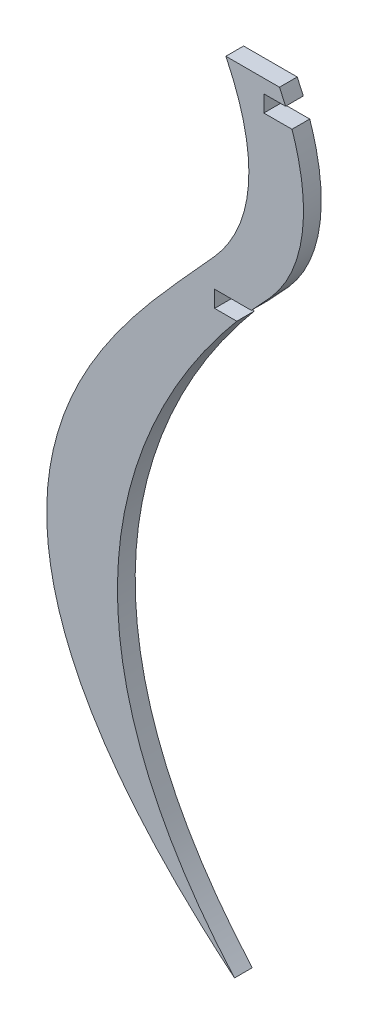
ISO-10303-21;
HEADER;
FILE_DESCRIPTION(('STEP AP214'),'2;1');
FILE_NAME('part.step','',(''),(''),'','','');
FILE_SCHEMA(('AUTOMOTIVE_DESIGN { 1 0 10303 214 1 1 1 1 }'));
ENDSEC;
DATA;
#1=APPLICATION_CONTEXT('core data for automotive mechanical design processes');
#2=APPLICATION_PROTOCOL_DEFINITION('international standard','automotive_design',2000,#1);
#3=PRODUCT_CONTEXT('',#1,'mechanical');
#4=PRODUCT('Part','Part','',(#3));
#5=PRODUCT_RELATED_PRODUCT_CATEGORY('part','',(#4));
#6=PRODUCT_DEFINITION_FORMATION('','',#4);
#7=PRODUCT_DEFINITION_CONTEXT('part definition',#1,'design');
#8=PRODUCT_DEFINITION('design','',#6,#7);
#9=PRODUCT_DEFINITION_SHAPE('','',#8);
#10=(LENGTH_UNIT() NAMED_UNIT(*) SI_UNIT(.MILLI.,.METRE.));
#11=(NAMED_UNIT(*) PLANE_ANGLE_UNIT() SI_UNIT($,.RADIAN.));
#12=(NAMED_UNIT(*) SI_UNIT($,.STERADIAN.) SOLID_ANGLE_UNIT());
#13=UNCERTAINTY_MEASURE_WITH_UNIT(LENGTH_MEASURE(1.E-05),#10,'distance_accuracy_value','');
#14=(GEOMETRIC_REPRESENTATION_CONTEXT(3) GLOBAL_UNCERTAINTY_ASSIGNED_CONTEXT((#13)) GLOBAL_UNIT_ASSIGNED_CONTEXT((#10,
#11,#12)) REPRESENTATION_CONTEXT('',''));
#15=CARTESIAN_POINT('',(0.,0.,0.));
#16=DIRECTION('',(0.,0.,1.));
#17=DIRECTION('',(1.,0.,0.));
#18=AXIS2_PLACEMENT_3D('',#15,#16,#17);
#19=CARTESIAN_POINT('',(-237.1773,-95.6704,5.36));
#20=CARTESIAN_POINT('',(-304.5292,-19.3041,5.36));
#21=CARTESIAN_POINT('',(-259.1311,49.665,5.36));
#22=CARTESIAN_POINT('',(-236.4907,76.6189,5.36));
#23=B_SPLINE_CURVE_WITH_KNOTS('',3,(#19,#20,#21,#22),.UNSPECIFIED.,.F.,.F.,(4,4),(0.,1.),.UNSPECIFIED.);
#24=DIRECTION('',(0.,0.,-1.));
#25=VECTOR('',#24,1.);
#26=SURFACE_OF_LINEAR_EXTRUSION('',#23,#25);
#27=CARTESIAN_POINT('',(-237.1773,-95.6704,0.));
#28=CARTESIAN_POINT('',(-304.5292,-19.3041,0.));
#29=CARTESIAN_POINT('',(-259.1311,49.665,0.));
#30=CARTESIAN_POINT('',(-236.4907,76.6189,0.));
#31=B_SPLINE_CURVE_WITH_KNOTS('',3,(#27,#28,#29,#30),.UNSPECIFIED.,.F.,.F.,(4,4),(0.,1.),.UNSPECIFIED.);
#32=CARTESIAN_POINT('',(-237.1773,-95.6704,0.));
#33=VERTEX_POINT('',#32);
#34=CARTESIAN_POINT('',(-236.4907,76.6189,0.));
#35=VERTEX_POINT('',#34);
#36=EDGE_CURVE('E242',#33,#35,#31,.T.);
#37=ORIENTED_EDGE('',*,*,#36,.T.);
#38=DIRECTION('',(0.,0.,-1.));
#39=VECTOR('',#38,1.);
#40=CARTESIAN_POINT('',(-236.4907,76.6189,5.36));
#41=LINE('',#40,#39);
#42=CARTESIAN_POINT('',(-236.4907,76.6189,5.36));
#43=VERTEX_POINT('',#42);
#44=EDGE_CURVE('E11',#43,#35,#41,.T.);
#45=ORIENTED_EDGE('',*,*,#44,.F.);
#46=CARTESIAN_POINT('',(-237.1773,-95.6704,5.36));
#47=VERTEX_POINT('',#46);
#48=EDGE_CURVE('E292',#47,#43,#23,.T.);
#49=ORIENTED_EDGE('',*,*,#48,.F.);
#50=DIRECTION('',(0.,0.,-1.));
#51=VECTOR('',#50,1.);
#52=CARTESIAN_POINT('',(-237.1773,-95.6704,5.36));
#53=LINE('',#52,#51);
#54=EDGE_CURVE('E156',#47,#33,#53,.T.);
#55=ORIENTED_EDGE('',*,*,#54,.T.);
#56=EDGE_LOOP('',(#37,#45,#49,#55));
#57=FACE_BOUND('',#56,.T.);
#58=ADVANCED_FACE('F33',(#57),#26,.F.);
#59=CARTESIAN_POINT('',(-236.4907,76.6189,5.36));
#60=DIRECTION('',(0.,-1.,0.));
#61=DIRECTION('',(0.,0.,-1.));
#62=AXIS2_PLACEMENT_3D('',#59,#60,#61);
#63=PLANE('',#62);
#64=DIRECTION('',(-1.,0.,0.));
#65=VECTOR('',#64,1.);
#66=CARTESIAN_POINT('',(-236.4907,76.6189,0.));
#67=LINE('',#66,#65);
#68=CARTESIAN_POINT('',(-243.2031,76.6189,0.));
#69=VERTEX_POINT('',#68);
#70=EDGE_CURVE('E233',#35,#69,#67,.T.);
#71=ORIENTED_EDGE('',*,*,#70,.T.);
#72=DIRECTION('',(0.,0.,-1.));
#73=VECTOR('',#72,1.);
#74=CARTESIAN_POINT('',(-243.2031,76.6189,5.36));
#75=LINE('',#74,#73);
#76=CARTESIAN_POINT('',(-243.2031,76.6189,5.36));
#77=VERTEX_POINT('',#76);
#78=EDGE_CURVE('E42',#77,#69,#75,.T.);
#79=ORIENTED_EDGE('',*,*,#78,.F.);
#80=DIRECTION('',(-1.,0.,0.));
#81=VECTOR('',#80,1.);
#82=CARTESIAN_POINT('',(-236.4907,76.6189,5.36));
#83=LINE('',#82,#81);
#84=EDGE_CURVE('E108',#43,#77,#83,.T.);
#85=ORIENTED_EDGE('',*,*,#84,.F.);
#86=ORIENTED_EDGE('',*,*,#44,.T.);
#87=EDGE_LOOP('',(#71,#79,#85,#86));
#88=FACE_BOUND('',#87,.T.);
#89=ADVANCED_FACE('F226',(#88),#63,.F.);
#90=CARTESIAN_POINT('',(-243.2031,76.6189,5.36));
#91=DIRECTION('',(-1.,0.,0.));
#92=DIRECTION('',(0.,0.,1.));
#93=AXIS2_PLACEMENT_3D('',#90,#91,#92);
#94=PLANE('',#93);
#95=DIRECTION('',(0.,1.,0.));
#96=VECTOR('',#95,1.);
#97=CARTESIAN_POINT('',(-243.2031,76.6189,0.));
#98=LINE('',#97,#96);
#99=CARTESIAN_POINT('',(-243.2031,81.6489,0.));
#100=VERTEX_POINT('',#99);
#101=EDGE_CURVE('E241',#69,#100,#98,.T.);
#102=ORIENTED_EDGE('',*,*,#101,.T.);
#103=DIRECTION('',(0.,0.,-1.));
#104=VECTOR('',#103,1.);
#105=CARTESIAN_POINT('',(-243.2031,81.6489,5.36));
#106=LINE('',#105,#104);
#107=CARTESIAN_POINT('',(-243.2031,81.6489,5.36));
#108=VERTEX_POINT('',#107);
#109=EDGE_CURVE('E247',#108,#100,#106,.T.);
#110=ORIENTED_EDGE('',*,*,#109,.F.);
#111=DIRECTION('',(0.,1.,0.));
#112=VECTOR('',#111,1.);
#113=CARTESIAN_POINT('',(-243.2031,76.6189,5.36));
#114=LINE('',#113,#112);
#115=EDGE_CURVE('E246',#77,#108,#114,.T.);
#116=ORIENTED_EDGE('',*,*,#115,.F.);
#117=ORIENTED_EDGE('',*,*,#78,.T.);
#118=EDGE_LOOP('',(#102,#110,#116,#117));
#119=FACE_BOUND('',#118,.T.);
#120=ADVANCED_FACE('F223',(#119),#94,.F.);
#121=CARTESIAN_POINT('',(-243.2031,81.6489,5.36));
#122=DIRECTION('',(0.,1.,0.));
#123=DIRECTION('',(0.,0.,1.));
#124=AXIS2_PLACEMENT_3D('',#121,#122,#123);
#125=PLANE('',#124);
#126=DIRECTION('',(1.,0.,0.));
#127=VECTOR('',#126,1.);
#128=CARTESIAN_POINT('',(-243.2031,81.6489,0.));
#129=LINE('',#128,#127);
#130=CARTESIAN_POINT('',(-232.1178,81.6489,0.));
#131=VERTEX_POINT('',#130);
#132=EDGE_CURVE('E251',#100,#131,#129,.T.);
#133=ORIENTED_EDGE('',*,*,#132,.T.);
#134=DIRECTION('',(0.,0.,-1.));
#135=VECTOR('',#134,1.);
#136=CARTESIAN_POINT('',(-232.1178,81.6489,5.36));
#137=LINE('',#136,#135);
#138=CARTESIAN_POINT('',(-232.1178,81.6489,5.36));
#139=VERTEX_POINT('',#138);
#140=EDGE_CURVE('E314',#139,#131,#137,.T.);
#141=ORIENTED_EDGE('',*,*,#140,.F.);
#142=DIRECTION('',(1.,0.,0.));
#143=VECTOR('',#142,1.);
#144=CARTESIAN_POINT('',(-243.2031,81.6489,5.36));
#145=LINE('',#144,#143);
#146=EDGE_CURVE('E319',#108,#139,#145,.T.);
#147=ORIENTED_EDGE('',*,*,#146,.F.);
#148=ORIENTED_EDGE('',*,*,#109,.T.);
#149=EDGE_LOOP('',(#133,#141,#147,#148));
#150=FACE_BOUND('',#149,.T.);
#151=ADVANCED_FACE('F219',(#150),#125,.F.);
#152=CARTESIAN_POINT('',(-232.1178,81.6489,5.36));
#153=CARTESIAN_POINT('',(-229.2456,84.8441,5.36));
#154=CARTESIAN_POINT('',(-227.1269,87.0011,5.36));
#155=CARTESIAN_POINT('',(-226.2449,87.996,5.36));
#156=B_SPLINE_CURVE_WITH_KNOTS('',3,(#152,#153,#154,#155),.UNSPECIFIED.,.F.,.F.,(4,4),
(0.333333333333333,1.),.UNSPECIFIED.);
#157=DIRECTION('',(0.,0.,-1.));
#158=VECTOR('',#157,1.);
#159=SURFACE_OF_LINEAR_EXTRUSION('',#156,#158);
#160=CARTESIAN_POINT('',(-232.1178,81.6489,0.));
#161=CARTESIAN_POINT('',(-229.2456,84.8441,0.));
#162=CARTESIAN_POINT('',(-227.1269,87.0011,0.));
#163=CARTESIAN_POINT('',(-226.2449,87.996,0.));
#164=B_SPLINE_CURVE_WITH_KNOTS('',3,(#160,#161,#162,#163),.UNSPECIFIED.,.F.,.F.,(4,4),
(0.333333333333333,1.),.UNSPECIFIED.);
#165=CARTESIAN_POINT('',(-226.2449,87.996,0.));
#166=VERTEX_POINT('',#165);
#167=EDGE_CURVE('E253',#131,#166,#164,.T.);
#168=ORIENTED_EDGE('',*,*,#167,.T.);
#169=DIRECTION('',(0.,0.,-1.));
#170=VECTOR('',#169,1.);
#171=CARTESIAN_POINT('',(-226.2449,87.996,5.36));
#172=LINE('',#171,#170);
#173=CARTESIAN_POINT('',(-226.2449,87.996,5.36));
#174=VERTEX_POINT('',#173);
#175=EDGE_CURVE('E311',#174,#166,#172,.T.);
#176=ORIENTED_EDGE('',*,*,#175,.F.);
#177=EDGE_CURVE('E201',#139,#174,#156,.T.);
#178=ORIENTED_EDGE('',*,*,#177,.F.);
#179=ORIENTED_EDGE('',*,*,#140,.T.);
#180=EDGE_LOOP('',(#168,#176,#178,#179));
#181=FACE_BOUND('',#180,.T.);
#182=ADVANCED_FACE('F215',(#181),#159,.F.);
#183=CARTESIAN_POINT('',(-226.2449,87.996,5.36));
#184=CARTESIAN_POINT('',(-215.766,99.8215,5.36));
#185=CARTESIAN_POINT('',(-213.5219,116.8631,5.36));
#186=CARTESIAN_POINT('',(-219.8019,135.2076,5.36));
#187=B_SPLINE_CURVE_WITH_KNOTS('',3,(#183,#184,#185,#186),.UNSPECIFIED.,.F.,.F.,(4,4),(0.,
0.333333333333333),.UNSPECIFIED.);
#188=DIRECTION('',(0.,0.,-1.));
#189=VECTOR('',#188,1.);
#190=SURFACE_OF_LINEAR_EXTRUSION('',#187,#189);
#191=CARTESIAN_POINT('',(-226.2449,87.996,0.));
#192=CARTESIAN_POINT('',(-215.766,99.8215,0.));
#193=CARTESIAN_POINT('',(-213.5219,116.8631,0.));
#194=CARTESIAN_POINT('',(-219.8019,135.2076,0.));
#195=B_SPLINE_CURVE_WITH_KNOTS('',3,(#191,#192,#193,#194),.UNSPECIFIED.,.F.,.F.,(4,4),(0.,
0.333333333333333),.UNSPECIFIED.);
#196=CARTESIAN_POINT('',(-219.8019,135.2076,0.));
#197=VERTEX_POINT('',#196);
#198=EDGE_CURVE('E259',#166,#197,#195,.T.);
#199=ORIENTED_EDGE('',*,*,#198,.T.);
#200=DIRECTION('',(0.,0.,-1.));
#201=VECTOR('',#200,1.);
#202=CARTESIAN_POINT('',(-219.8019,135.2076,5.36));
#203=LINE('',#202,#201);
#204=CARTESIAN_POINT('',(-219.8019,135.2076,5.36));
#205=VERTEX_POINT('',#204);
#206=EDGE_CURVE('E308',#205,#197,#203,.T.);
#207=ORIENTED_EDGE('',*,*,#206,.F.);
#208=EDGE_CURVE('E196',#174,#205,#187,.T.);
#209=ORIENTED_EDGE('',*,*,#208,.F.);
#210=ORIENTED_EDGE('',*,*,#175,.T.);
#211=EDGE_LOOP('',(#199,#207,#209,#210));
#212=FACE_BOUND('',#211,.T.);
#213=ADVANCED_FACE('F210',(#212),#190,.F.);
#214=CARTESIAN_POINT('',(-219.8019,135.2076,5.36));
#215=DIRECTION('',(0.000575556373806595,-0.999999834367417,0.));
#216=DIRECTION('',(0.999999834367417,0.000575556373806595,0.));
#217=AXIS2_PLACEMENT_3D('',#214,#215,#216);
#218=PLANE('',#217);
#219=DIRECTION('',(-0.999999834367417,-0.000575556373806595,0.));
#220=VECTOR('',#219,1.);
#221=CARTESIAN_POINT('',(-219.8019,135.2076,0.));
#222=LINE('',#221,#220);
#223=CARTESIAN_POINT('',(-228.3154,135.2027,0.));
#224=VERTEX_POINT('',#223);
#225=EDGE_CURVE('E266',#197,#224,#222,.T.);
#226=ORIENTED_EDGE('',*,*,#225,.T.);
#227=DIRECTION('',(0.,0.,-1.));
#228=VECTOR('',#227,1.);
#229=CARTESIAN_POINT('',(-228.3154,135.2027,5.36));
#230=LINE('',#229,#228);
#231=CARTESIAN_POINT('',(-228.3154,135.2027,5.36));
#232=VERTEX_POINT('',#231);
#233=EDGE_CURVE('E305',#232,#224,#230,.T.);
#234=ORIENTED_EDGE('',*,*,#233,.F.);
#235=DIRECTION('',(-0.999999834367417,-0.000575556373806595,0.));
#236=VECTOR('',#235,1.);
#237=CARTESIAN_POINT('',(-219.8019,135.2076,5.36));
#238=LINE('',#237,#236);
#239=EDGE_CURVE('E194',#205,#232,#238,.T.);
#240=ORIENTED_EDGE('',*,*,#239,.F.);
#241=ORIENTED_EDGE('',*,*,#206,.T.);
#242=EDGE_LOOP('',(#226,#234,#240,#241));
#243=FACE_BOUND('',#242,.T.);
#244=ADVANCED_FACE('F214',(#243),#218,.F.);
#245=CARTESIAN_POINT('',(-228.3154,135.2027,5.36));
#246=DIRECTION('',(-1.,0.,0.));
#247=DIRECTION('',(0.,0.,1.));
#248=AXIS2_PLACEMENT_3D('',#245,#246,#247);
#249=PLANE('',#248);
#250=DIRECTION('',(0.,1.,0.));
#251=VECTOR('',#250,1.);
#252=CARTESIAN_POINT('',(-228.3154,135.2027,0.));
#253=LINE('',#252,#251);
#254=CARTESIAN_POINT('',(-228.3154,140.2328,0.));
#255=VERTEX_POINT('',#254);
#256=EDGE_CURVE('E271',#224,#255,#253,.T.);
#257=ORIENTED_EDGE('',*,*,#256,.T.);
#258=DIRECTION('',(0.,0.,-1.));
#259=VECTOR('',#258,1.);
#260=CARTESIAN_POINT('',(-228.3154,140.2328,5.36));
#261=LINE('',#260,#259);
#262=CARTESIAN_POINT('',(-228.3154,140.2328,5.36));
#263=VERTEX_POINT('',#262);
#264=EDGE_CURVE('E302',#263,#255,#261,.T.);
#265=ORIENTED_EDGE('',*,*,#264,.F.);
#266=DIRECTION('',(0.,1.,0.));
#267=VECTOR('',#266,1.);
#268=CARTESIAN_POINT('',(-228.3154,135.2027,5.36));
#269=LINE('',#268,#267);
#270=EDGE_CURVE('E192',#232,#263,#269,.T.);
#271=ORIENTED_EDGE('',*,*,#270,.F.);
#272=ORIENTED_EDGE('',*,*,#233,.T.);
#273=EDGE_LOOP('',(#257,#265,#271,#272));
#274=FACE_BOUND('',#273,.T.);
#275=ADVANCED_FACE('F344',(#274),#249,.F.);
#276=CARTESIAN_POINT('',(-228.3154,140.2328,5.36));
#277=DIRECTION('',(-0.00515347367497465,0.999986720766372,0.));
#278=DIRECTION('',(-0.999986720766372,-0.00515347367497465,0.));
#279=AXIS2_PLACEMENT_3D('',#276,#277,#278);
#280=PLANE('',#279);
#281=DIRECTION('',(0.999986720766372,0.00515347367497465,0.));
#282=VECTOR('',#281,1.);
#283=CARTESIAN_POINT('',(-228.3154,140.2328,0.));
#284=LINE('',#283,#282);
#285=CARTESIAN_POINT('',(-221.7374,140.2667,0.));
#286=VERTEX_POINT('',#285);
#287=EDGE_CURVE('E273',#255,#286,#284,.T.);
#288=ORIENTED_EDGE('',*,*,#287,.T.);
#289=DIRECTION('',(0.,0.,-1.));
#290=VECTOR('',#289,1.);
#291=CARTESIAN_POINT('',(-221.7374,140.2667,5.36));
#292=LINE('',#291,#290);
#293=CARTESIAN_POINT('',(-221.7374,140.2667,5.36));
#294=VERTEX_POINT('',#293);
#295=EDGE_CURVE('E299',#294,#286,#292,.T.);
#296=ORIENTED_EDGE('',*,*,#295,.F.);
#297=DIRECTION('',(0.999986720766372,0.00515347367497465,0.));
#298=VECTOR('',#297,1.);
#299=CARTESIAN_POINT('',(-228.3154,140.2328,5.36));
#300=LINE('',#299,#298);
#301=EDGE_CURVE('E187',#263,#294,#300,.T.);
#302=ORIENTED_EDGE('',*,*,#301,.F.);
#303=ORIENTED_EDGE('',*,*,#264,.T.);
#304=EDGE_LOOP('',(#288,#296,#302,#303));
#305=FACE_BOUND('',#304,.T.);
#306=ADVANCED_FACE('F180',(#305),#280,.F.);
#307=CARTESIAN_POINT('',(-221.7374,140.2667,5.36));
#308=CARTESIAN_POINT('',(-222.3079,141.6165,5.36));
#309=CARTESIAN_POINT('',(-222.9235,142.9711,5.36));
#310=CARTESIAN_POINT('',(-223.5846,144.3294,5.36));
#311=B_SPLINE_CURVE_WITH_KNOTS('',3,(#307,#308,#309,#310),.UNSPECIFIED.,.F.,.F.,(4,4),(0.,1.),.UNSPECIFIED.);
#312=DIRECTION('',(0.,0.,-1.));
#313=VECTOR('',#312,1.);
#314=SURFACE_OF_LINEAR_EXTRUSION('',#311,#313);
#315=CARTESIAN_POINT('',(-221.7374,140.2667,0.));
#316=CARTESIAN_POINT('',(-222.3079,141.6165,0.));
#317=CARTESIAN_POINT('',(-222.9235,142.9711,0.));
#318=CARTESIAN_POINT('',(-223.5846,144.3294,0.));
#319=B_SPLINE_CURVE_WITH_KNOTS('',3,(#315,#316,#317,#318),.UNSPECIFIED.,.F.,.F.,(4,4),(0.,1.),.UNSPECIFIED.);
#320=CARTESIAN_POINT('',(-223.5846,144.3294,0.));
#321=VERTEX_POINT('',#320);
#322=EDGE_CURVE('E275',#286,#321,#319,.T.);
#323=ORIENTED_EDGE('',*,*,#322,.T.);
#324=DIRECTION('',(0.,0.,-1.));
#325=VECTOR('',#324,1.);
#326=CARTESIAN_POINT('',(-223.5846,144.3294,5.36));
#327=LINE('',#326,#325);
#328=CARTESIAN_POINT('',(-223.5846,144.3294,5.36));
#329=VERTEX_POINT('',#328);
#330=EDGE_CURVE('E151',#329,#321,#327,.T.);
#331=ORIENTED_EDGE('',*,*,#330,.F.);
#332=EDGE_CURVE('E142',#294,#329,#311,.T.);
#333=ORIENTED_EDGE('',*,*,#332,.F.);
#334=ORIENTED_EDGE('',*,*,#295,.T.);
#335=EDGE_LOOP('',(#323,#331,#333,#334));
#336=FACE_BOUND('',#335,.T.);
#337=ADVANCED_FACE('F177',(#336),#314,.F.);
#338=CARTESIAN_POINT('',(-239.7917,144.329,5.36));
#339=DIRECTION('',(2.46805412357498E-05,-0.999999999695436,0.));
#340=DIRECTION('',(0.999999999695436,2.46805412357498E-05,0.));
#341=AXIS2_PLACEMENT_3D('',#338,#339,#340);
#342=PLANE('',#341);
#343=DIRECTION('',(-0.999999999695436,-2.46805412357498E-05,0.));
#344=VECTOR('',#343,1.);
#345=CARTESIAN_POINT('',(-239.7917,144.329,0.));
#346=LINE('',#345,#344);
#347=CARTESIAN_POINT('',(-239.7917,144.329,0.));
#348=VERTEX_POINT('',#347);
#349=EDGE_CURVE('E150',#321,#348,#346,.T.);
#350=ORIENTED_EDGE('',*,*,#349,.T.);
#351=DIRECTION('',(0.,0.,-1.));
#352=VECTOR('',#351,1.);
#353=CARTESIAN_POINT('',(-239.7917,144.329,5.36));
#354=LINE('',#353,#352);
#355=CARTESIAN_POINT('',(-239.7917,144.329,5.36));
#356=VERTEX_POINT('',#355);
#357=EDGE_CURVE('E147',#356,#348,#354,.T.);
#358=ORIENTED_EDGE('',*,*,#357,.F.);
#359=DIRECTION('',(-0.999999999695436,-2.46805412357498E-05,0.));
#360=VECTOR('',#359,1.);
#361=CARTESIAN_POINT('',(-239.7917,144.329,5.36));
#362=LINE('',#361,#360);
#363=EDGE_CURVE('E136',#329,#356,#362,.T.);
#364=ORIENTED_EDGE('',*,*,#363,.F.);
#365=ORIENTED_EDGE('',*,*,#330,.T.);
#366=EDGE_LOOP('',(#350,#358,#364,#365));
#367=FACE_BOUND('',#366,.T.);
#368=ADVANCED_FACE('F148',(#367),#342,.F.);
#369=CARTESIAN_POINT('',(-239.7917,144.329,5.36));
#370=CARTESIAN_POINT('',(-229.2139,122.5984,5.36));
#371=CARTESIAN_POINT('',(-230.9954,103.9899,5.36));
#372=CARTESIAN_POINT('',(-243.1945,90.2231,5.36));
#373=B_SPLINE_CURVE_WITH_KNOTS('',3,(#369,#370,#371,#372),.UNSPECIFIED.,.F.,.F.,(4,4),
(0.333333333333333,1.),.UNSPECIFIED.);
#374=DIRECTION('',(0.,0.,-1.));
#375=VECTOR('',#374,1.);
#376=SURFACE_OF_LINEAR_EXTRUSION('',#373,#375);
#377=CARTESIAN_POINT('',(-239.7917,144.329,0.));
#378=CARTESIAN_POINT('',(-229.2139,122.5984,0.));
#379=CARTESIAN_POINT('',(-230.9954,103.9899,0.));
#380=CARTESIAN_POINT('',(-243.1945,90.2231,0.));
#381=B_SPLINE_CURVE_WITH_KNOTS('',3,(#377,#378,#379,#380),.UNSPECIFIED.,.F.,.F.,(4,4),
(0.333333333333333,1.),.UNSPECIFIED.);
#382=CARTESIAN_POINT('',(-243.1945,90.2231,0.));
#383=VERTEX_POINT('',#382);
#384=EDGE_CURVE('E94',#348,#383,#381,.T.);
#385=ORIENTED_EDGE('',*,*,#384,.T.);
#386=DIRECTION('',(0.,0.,-1.));
#387=VECTOR('',#386,1.);
#388=CARTESIAN_POINT('',(-243.1945,90.2231,5.36));
#389=LINE('',#388,#387);
#390=CARTESIAN_POINT('',(-243.1945,90.2231,5.36));
#391=VERTEX_POINT('',#390);
#392=EDGE_CURVE('E152',#391,#383,#389,.T.);
#393=ORIENTED_EDGE('',*,*,#392,.F.);
#394=EDGE_CURVE('E140',#356,#391,#373,.T.);
#395=ORIENTED_EDGE('',*,*,#394,.F.);
#396=ORIENTED_EDGE('',*,*,#357,.T.);
#397=EDGE_LOOP('',(#385,#393,#395,#396));
#398=FACE_BOUND('',#397,.T.);
#399=ADVANCED_FACE('F154',(#398),#376,.F.);
#400=CARTESIAN_POINT('',(-243.1945,90.2231,5.36));
#401=CARTESIAN_POINT('',(-273.3917,56.1459,5.36));
#402=CARTESIAN_POINT('',(-343.5563,-7.3362,5.36));
#403=CARTESIAN_POINT('',(-237.1773,-95.6704,5.36));
#404=B_SPLINE_CURVE_WITH_KNOTS('',3,(#400,#401,#402,#403),.UNSPECIFIED.,.F.,.F.,(4,4),(0.,
0.333333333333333),.UNSPECIFIED.);
#405=DIRECTION('',(0.,0.,-1.));
#406=VECTOR('',#405,1.);
#407=SURFACE_OF_LINEAR_EXTRUSION('',#404,#406);
#408=CARTESIAN_POINT('',(-243.1945,90.2231,0.));
#409=CARTESIAN_POINT('',(-273.3917,56.1459,0.));
#410=CARTESIAN_POINT('',(-343.5563,-7.3362,0.));
#411=CARTESIAN_POINT('',(-237.1773,-95.6704,0.));
#412=B_SPLINE_CURVE_WITH_KNOTS('',3,(#408,#409,#410,#411),.UNSPECIFIED.,.F.,.F.,(4,4),(0.,
0.333333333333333),.UNSPECIFIED.);
#413=EDGE_CURVE('E100',#383,#33,#412,.T.);
#414=ORIENTED_EDGE('',*,*,#413,.T.);
#415=ORIENTED_EDGE('',*,*,#54,.F.);
#416=EDGE_CURVE('E50',#391,#47,#404,.T.);
#417=ORIENTED_EDGE('',*,*,#416,.F.);
#418=ORIENTED_EDGE('',*,*,#392,.T.);
#419=EDGE_LOOP('',(#414,#415,#417,#418));
#420=FACE_BOUND('',#419,.T.);
#421=ADVANCED_FACE('F173',(#420),#407,.F.);
#422=CARTESIAN_POINT('',(-270.5811125,9.0039,5.36));
#423=DIRECTION('',(0.,0.,-1.));
#424=DIRECTION('',(-1.,0.,0.));
#425=AXIS2_PLACEMENT_3D('',#422,#423,#424);
#426=PLANE('',#425);
#427=ORIENTED_EDGE('',*,*,#48,.T.);
#428=ORIENTED_EDGE('',*,*,#84,.T.);
#429=ORIENTED_EDGE('',*,*,#115,.T.);
#430=ORIENTED_EDGE('',*,*,#146,.T.);
#431=ORIENTED_EDGE('',*,*,#177,.T.);
#432=ORIENTED_EDGE('',*,*,#208,.T.);
#433=ORIENTED_EDGE('',*,*,#239,.T.);
#434=ORIENTED_EDGE('',*,*,#270,.T.);
#435=ORIENTED_EDGE('',*,*,#301,.T.);
#436=ORIENTED_EDGE('',*,*,#332,.T.);
#437=ORIENTED_EDGE('',*,*,#363,.T.);
#438=ORIENTED_EDGE('',*,*,#394,.T.);
#439=ORIENTED_EDGE('',*,*,#416,.T.);
#440=EDGE_LOOP('',(#427,#428,#429,#430,#431,#432,#433,#434,#435,#436,#437,#438,#439));
#441=FACE_BOUND('',#440,.T.);
#442=ADVANCED_FACE('F138',(#441),#426,.F.);
#443=CARTESIAN_POINT('',(-270.5811125,9.0039,0.));
#444=DIRECTION('',(0.,0.,-1.));
#445=DIRECTION('',(-1.,0.,0.));
#446=AXIS2_PLACEMENT_3D('',#443,#444,#445);
#447=PLANE('',#446);
#448=ORIENTED_EDGE('',*,*,#36,.F.);
#449=ORIENTED_EDGE('',*,*,#413,.F.);
#450=ORIENTED_EDGE('',*,*,#384,.F.);
#451=ORIENTED_EDGE('',*,*,#349,.F.);
#452=ORIENTED_EDGE('',*,*,#322,.F.);
#453=ORIENTED_EDGE('',*,*,#287,.F.);
#454=ORIENTED_EDGE('',*,*,#256,.F.);
#455=ORIENTED_EDGE('',*,*,#225,.F.);
#456=ORIENTED_EDGE('',*,*,#198,.F.);
#457=ORIENTED_EDGE('',*,*,#167,.F.);
#458=ORIENTED_EDGE('',*,*,#132,.F.);
#459=ORIENTED_EDGE('',*,*,#101,.F.);
#460=ORIENTED_EDGE('',*,*,#70,.F.);
#461=EDGE_LOOP('',(#448,#449,#450,#451,#452,#453,#454,#455,#456,#457,#458,#459,#460));
#462=FACE_BOUND('',#461,.T.);
#463=ADVANCED_FACE('F249',(#462),#447,.T.);
#464=CLOSED_SHELL('',(#58,#89,#120,#151,#182,#213,#244,#275,#306,#337,#368,#399,#421,#442,#463));
#465=MANIFOLD_SOLID_BREP('B2',#464);
#466=ADVANCED_BREP_SHAPE_REPRESENTATION('',(#18,#465),#14);
#467=SHAPE_DEFINITION_REPRESENTATION(#9,#466);
ENDSEC;
END-ISO-10303-21;
